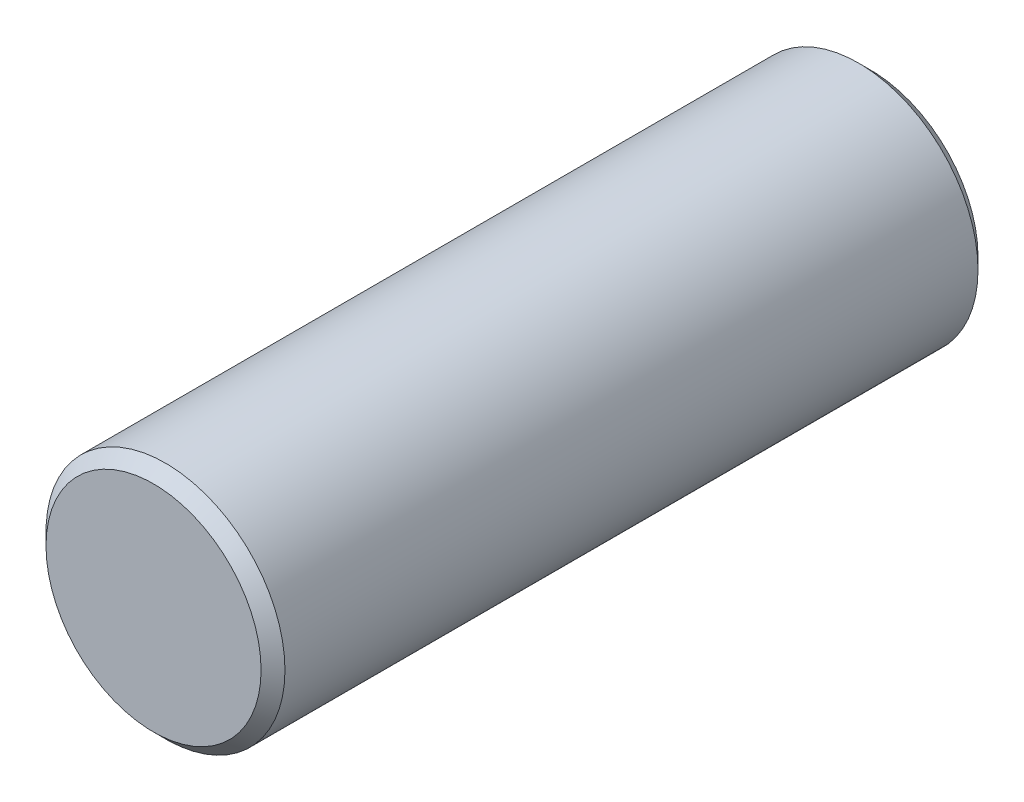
from build123d import *

# Parameters (mm, degrees)
CROQUIS1_R     = 5
EXTRUIR1_DEPTH = 30
CHAFL_N1_SIZE  = 0.5


with BuildPart() as part:
    # Croquis1 → Extruir1 (new body)
    with BuildSketch(Plane.XY):
        Circle(CROQUIS1_R)
    extrude(amount=EXTRUIR1_DEPTH)

    # Chafl_n1
    chafl_n1_edges = [part.edges().sort_by_distance(p)[0] for p in [
        (-5, 0, 0),
        (-5, 0, 30),
    ]]
    chamfer(chafl_n1_edges, length=CHAFL_N1_SIZE)


solid = part.part
